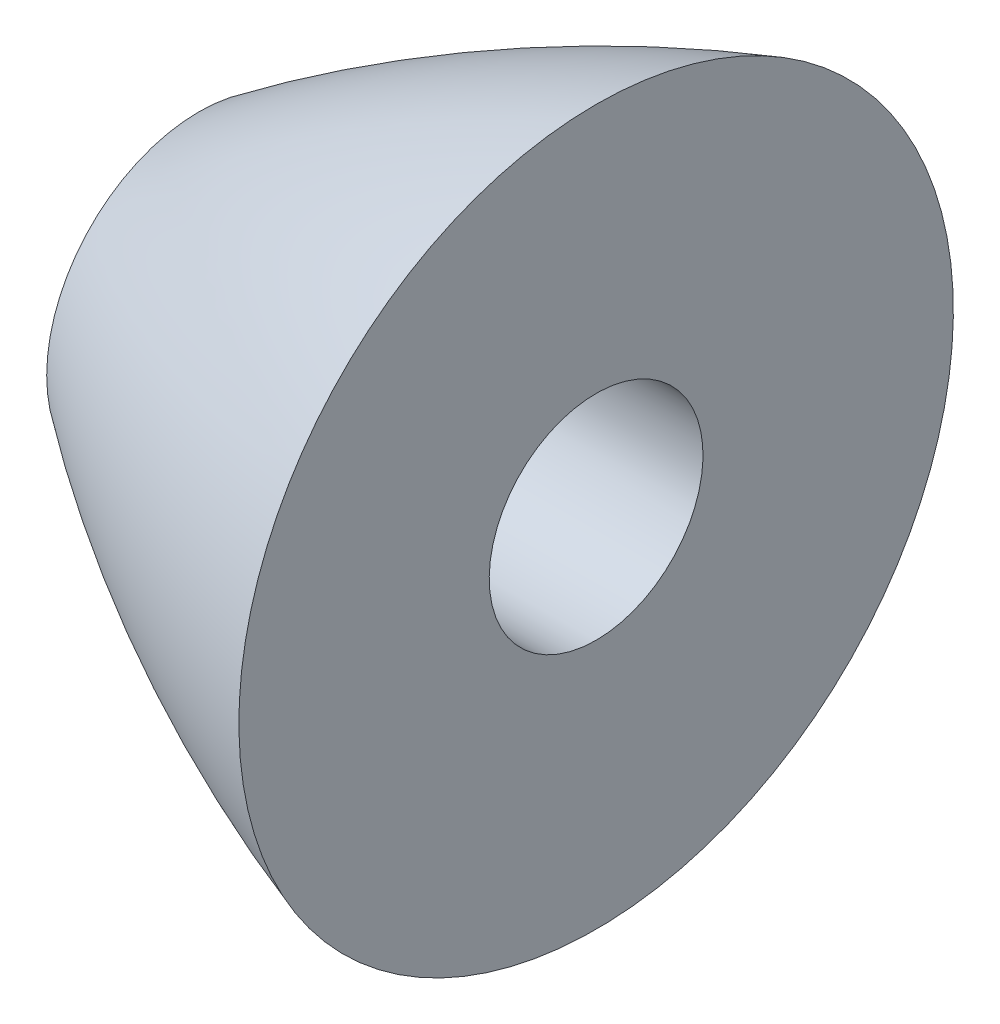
from build123d import *

# Parameters (mm, degrees)
CUT_EXTRUDE1_DEPTH              = 15.317174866
CUT_EXTRUDE1_DEPTH_BACK         = 15.317174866
SKETCH2_R                       = 2
CUT_EXTRUDE2_START              = -3
SKETCH2_3_R                     = 2.85
SKETCH2_3_R_2                   = 2
CUT_EXTRUDE2_DEPTH              = 10.736670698
BOSS_EXTRUDE1_REACH             = 20.738
BOSS_EXTRUDE1_DIRECTION_2_REACH = 20.738
CUT_EXTRUDE3_DEPTH              = 13.022159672
CUT_EXTRUDE3_DEPTH_BACK         = 13.022159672
SKETCH5_R                       = 2


with BuildPart() as part:
    # Sketch1 → Revolve1 (revolve)
    with BuildSketch(Plane.XY):
        with BuildLine():
            Line((-8.75, 0), (-8.75, 6.683664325))
            ThreePointArc((-8.75, 6.683664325), (-14.516664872, 3.969140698), (-19.503546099, 0))
            Line((-19.503546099, 0), (-8.75, 0))
        make_face()
    revolve(axis=Axis((19.503546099, 0, 0), (-1, 0, 0)))

    # Sketch2 → Cut-Extrude1 (cut, two sides: drawn at the far end of the back side and taken through both)
    with BuildSketch(Plane(origin=(-8.75, 0, 0), x_dir=(0, 0, -1), z_dir=(1, 0, 0)).offset(-CUT_EXTRUDE1_DEPTH_BACK)):
        with Locations(Location((0, 0, 0), (0, 0, 90))):
            Circle(SKETCH2_R)
    extrude(amount=CUT_EXTRUDE1_DEPTH + CUT_EXTRUDE1_DEPTH_BACK, mode=Mode.SUBTRACT)

    # Sketch2_3 → Cut-Extrude2 (cut, through all)
    with BuildSketch(Plane(origin=(-8.75, 0, 0), x_dir=(0, 0, -1), z_dir=(1, 0, 0)).offset(CUT_EXTRUDE2_START)):
        Circle(SKETCH2_3_R)
        Circle(SKETCH2_3_R_2, mode=Mode.SUBTRACT)
    extrude(amount=-CUT_EXTRUDE2_DEPTH, mode=Mode.SUBTRACT)

    # Sketch4 → Boss-Extrude1 (add, up to next)
    with BuildSketch(Plane(origin=(0, 0, 0), x_dir=(1, 0, 0), z_dir=(0, 1, 0)), mode=Mode.PRIVATE) as boss_extrude1_sk1:
        Polygon((-14.907894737, -2.9), (-11.75, -2.9), (-11.75, -1.9), (-14.25, -1.9), align=None)
    boss_extrude1_tool1 = extrude(boss_extrude1_sk1.sketch, amount=-BOSS_EXTRUDE1_REACH, mode=Mode.PRIVATE) - part.part
    # Sketch4 → Boss-Extrude1 (add, up to next)
    with BuildSketch(Plane(origin=(0, 0, 0), x_dir=(1, 0, 0), z_dir=(0, 1, 0)), mode=Mode.PRIVATE) as boss_extrude1_sk2:
        Polygon((-14.25, -1.9), (-11.75, -1.9), (-11.75, 1.9), align=None)
    boss_extrude1_tool2 = extrude(boss_extrude1_sk2.sketch, amount=-BOSS_EXTRUDE1_REACH, mode=Mode.PRIVATE) - part.part
    add(boss_extrude1_tool1.solids().sort_by_distance((-13.170849, 0, 2.41938))[0])
    add(boss_extrude1_tool2.solids().sort_by_distance((-12.583333, 0, 0.633333))[0])

    # Sketch4 → Boss-Extrude1 direction 2 (add, up to next)
    with BuildSketch(Plane(origin=(0, 0, 0), x_dir=(1, 0, 0), z_dir=(0, 1, 0)), mode=Mode.PRIVATE) as boss_extrude1_direction_2_sk1:
        Polygon((-14.907894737, -2.9), (-11.75, -2.9), (-11.75, -1.9), (-14.25, -1.9), align=None)
    boss_extrude1_direction_2_tool1 = extrude(boss_extrude1_direction_2_sk1.sketch, amount=BOSS_EXTRUDE1_DIRECTION_2_REACH, mode=Mode.PRIVATE) - part.part
    # Sketch4 → Boss-Extrude1 direction 2 (add, up to next)
    with BuildSketch(Plane(origin=(0, 0, 0), x_dir=(1, 0, 0), z_dir=(0, 1, 0)), mode=Mode.PRIVATE) as boss_extrude1_direction_2_sk2:
        Polygon((-14.25, -1.9), (-11.75, -1.9), (-11.75, 1.9), align=None)
    boss_extrude1_direction_2_tool2 = extrude(boss_extrude1_direction_2_sk2.sketch, amount=BOSS_EXTRUDE1_DIRECTION_2_REACH, mode=Mode.PRIVATE) - part.part
    add(boss_extrude1_direction_2_tool1.solids().sort_by_distance((-13.170849, 0, 2.41938))[0])
    add(boss_extrude1_direction_2_tool2.solids().sort_by_distance((-12.583333, 0, 0.633333))[0])

    # Sketch5 → Cut-Extrude3 (cut, two sides: drawn at the far end of the back side and taken through both)
    with BuildSketch(Plane(origin=(-8.75, 0, 0), x_dir=(0, 0, -1), z_dir=(1, 0, 0)).offset(-CUT_EXTRUDE3_DEPTH_BACK)):
        with Locations(Location((0, 0, 0), (0, 0, 18.194872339))):
            Circle(SKETCH5_R)
    extrude(amount=CUT_EXTRUDE3_DEPTH + CUT_EXTRUDE3_DEPTH_BACK, mode=Mode.SUBTRACT)


solid = part.part
